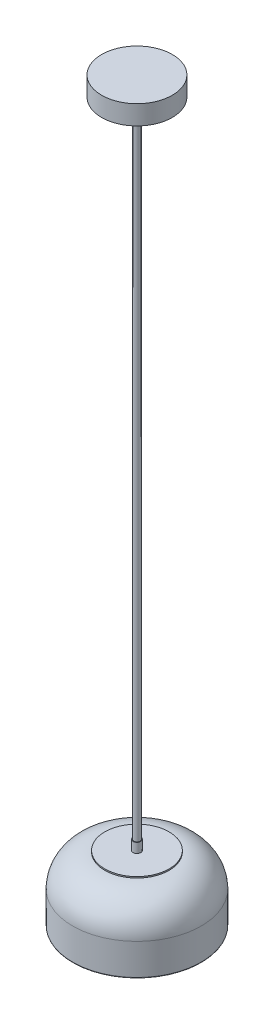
ISO-10303-21;
HEADER;
FILE_DESCRIPTION(('STEP AP214'),'2;1');
FILE_NAME('part.step','',(''),(''),'','','');
FILE_SCHEMA(('AUTOMOTIVE_DESIGN { 1 0 10303 214 1 1 1 1 }'));
ENDSEC;
DATA;
#1=APPLICATION_CONTEXT('core data for automotive mechanical design processes');
#2=APPLICATION_PROTOCOL_DEFINITION('international standard','automotive_design',2000,#1);
#3=PRODUCT_CONTEXT('',#1,'mechanical');
#4=PRODUCT('Part','Part','',(#3));
#5=PRODUCT_RELATED_PRODUCT_CATEGORY('part','',(#4));
#6=PRODUCT_DEFINITION_FORMATION('','',#4);
#7=PRODUCT_DEFINITION_CONTEXT('part definition',#1,'design');
#8=PRODUCT_DEFINITION('design','',#6,#7);
#9=PRODUCT_DEFINITION_SHAPE('','',#8);
#10=(LENGTH_UNIT() NAMED_UNIT(*) SI_UNIT(.MILLI.,.METRE.));
#11=(NAMED_UNIT(*) PLANE_ANGLE_UNIT() SI_UNIT($,.RADIAN.));
#12=(NAMED_UNIT(*) SI_UNIT($,.STERADIAN.) SOLID_ANGLE_UNIT());
#13=UNCERTAINTY_MEASURE_WITH_UNIT(LENGTH_MEASURE(1.E-05),#10,'distance_accuracy_value','');
#14=(GEOMETRIC_REPRESENTATION_CONTEXT(3) GLOBAL_UNCERTAINTY_ASSIGNED_CONTEXT((#13)) GLOBAL_UNIT_ASSIGNED_CONTEXT((#10,
#11,#12)) REPRESENTATION_CONTEXT('',''));
#15=CARTESIAN_POINT('',(0.,0.,0.));
#16=DIRECTION('',(0.,0.,1.));
#17=DIRECTION('',(1.,0.,0.));
#18=AXIS2_PLACEMENT_3D('',#15,#16,#17);
#19=CARTESIAN_POINT('',(0.,32.,0.));
#20=DIRECTION('',(0.,-1.,0.));
#21=DIRECTION('',(0.,0.,-1.));
#22=AXIS2_PLACEMENT_3D('',#19,#20,#21);
#23=CYLINDRICAL_SURFACE('',#22,50.);
#24=CARTESIAN_POINT('',(0.,32.,0.));
#25=DIRECTION('',(0.,1.,0.));
#26=DIRECTION('',(0.,0.,1.));
#27=AXIS2_PLACEMENT_3D('',#24,#25,#26);
#28=CIRCLE('',#27,50.);
#29=CARTESIAN_POINT('',(0.,32.,50.));
#30=VERTEX_POINT('',#29);
#31=EDGE_CURVE('E57',#30,#30,#28,.T.);
#32=ORIENTED_EDGE('',*,*,#31,.F.);
#33=EDGE_LOOP('',(#32));
#34=FACE_BOUND('',#33,.T.);
#35=CARTESIAN_POINT('',(0.,30.,0.));
#36=DIRECTION('',(0.,1.,0.));
#37=DIRECTION('',(0.,0.,1.));
#38=AXIS2_PLACEMENT_3D('',#35,#36,#37);
#39=CIRCLE('',#38,50.);
#40=CARTESIAN_POINT('',(0.,30.,50.));
#41=VERTEX_POINT('',#40);
#42=EDGE_CURVE('E52',#41,#41,#39,.T.);
#43=ORIENTED_EDGE('',*,*,#42,.T.);
#44=EDGE_LOOP('',(#43));
#45=FACE_BOUND('',#44,.T.);
#46=ADVANCED_FACE('F49',(#34,#45),#23,.T.);
#47=CARTESIAN_POINT('',(0.,32.,0.));
#48=DIRECTION('',(0.,1.,0.));
#49=DIRECTION('',(0.,0.,1.));
#50=AXIS2_PLACEMENT_3D('',#47,#48,#49);
#51=PLANE('',#50);
#52=CARTESIAN_POINT('',(0.,32.,0.));
#53=DIRECTION('',(0.,1.,0.));
#54=DIRECTION('',(0.,0.,1.));
#55=AXIS2_PLACEMENT_3D('',#52,#53,#54);
#56=CIRCLE('',#55,6.);
#57=CARTESIAN_POINT('',(0.,32.,6.));
#58=VERTEX_POINT('',#57);
#59=EDGE_CURVE('E71',#58,#58,#56,.T.);
#60=ORIENTED_EDGE('',*,*,#59,.F.);
#61=EDGE_LOOP('',(#60));
#62=FACE_BOUND('',#61,.T.);
#63=ORIENTED_EDGE('',*,*,#31,.T.);
#64=EDGE_LOOP('',(#63));
#65=FACE_BOUND('',#64,.T.);
#66=ADVANCED_FACE('F103',(#62,#65),#51,.T.);
#67=CARTESIAN_POINT('',(0.,30.,0.));
#68=DIRECTION('',(0.,1.,0.));
#69=DIRECTION('',(0.,0.,1.));
#70=AXIS2_PLACEMENT_3D('',#67,#68,#69);
#71=PLANE('',#70);
#72=ORIENTED_EDGE('',*,*,#42,.F.);
#73=EDGE_LOOP('',(#72));
#74=FACE_BOUND('',#73,.T.);
#75=ADVANCED_FACE('F108',(#74),#71,.F.);
#76=CARTESIAN_POINT('',(0.,47.,0.));
#77=DIRECTION('',(0.,-1.,0.));
#78=DIRECTION('',(0.,0.,-1.));
#79=AXIS2_PLACEMENT_3D('',#76,#77,#78);
#80=CYLINDRICAL_SURFACE('',#79,6.);
#81=CARTESIAN_POINT('',(0.,47.,0.));
#82=DIRECTION('',(0.,1.,0.));
#83=DIRECTION('',(0.,0.,1.));
#84=AXIS2_PLACEMENT_3D('',#81,#82,#83);
#85=CIRCLE('',#84,6.);
#86=CARTESIAN_POINT('',(0.,47.,6.));
#87=VERTEX_POINT('',#86);
#88=EDGE_CURVE('E67',#87,#87,#85,.T.);
#89=ORIENTED_EDGE('',*,*,#88,.F.);
#90=EDGE_LOOP('',(#89));
#91=FACE_BOUND('',#90,.T.);
#92=ORIENTED_EDGE('',*,*,#59,.T.);
#93=EDGE_LOOP('',(#92));
#94=FACE_BOUND('',#93,.T.);
#95=ADVANCED_FACE('F118',(#91,#94),#80,.T.);
#96=CARTESIAN_POINT('',(0.,47.,0.));
#97=DIRECTION('',(0.,1.,0.));
#98=DIRECTION('',(0.,0.,1.));
#99=AXIS2_PLACEMENT_3D('',#96,#97,#98);
#100=PLANE('',#99);
#101=CARTESIAN_POINT('',(0.,47.,0.));
#102=DIRECTION('',(0.,1.,0.));
#103=DIRECTION('',(0.,0.,1.));
#104=AXIS2_PLACEMENT_3D('',#101,#102,#103);
#105=CIRCLE('',#104,5.);
#106=CARTESIAN_POINT('',(0.,47.,5.));
#107=VERTEX_POINT('',#106);
#108=EDGE_CURVE('E11',#107,#107,#105,.T.);
#109=ORIENTED_EDGE('',*,*,#108,.F.);
#110=EDGE_LOOP('',(#109));
#111=FACE_BOUND('',#110,.T.);
#112=ORIENTED_EDGE('',*,*,#88,.T.);
#113=EDGE_LOOP('',(#112));
#114=FACE_BOUND('',#113,.T.);
#115=ADVANCED_FACE('F122',(#111,#114),#100,.T.);
#116=CARTESIAN_POINT('',(0.,1047.,0.));
#117=DIRECTION('',(0.,-1.,0.));
#118=DIRECTION('',(0.,0.,-1.));
#119=AXIS2_PLACEMENT_3D('',#116,#117,#118);
#120=CYLINDRICAL_SURFACE('',#119,5.);
#121=CARTESIAN_POINT('',(0.,1047.,0.));
#122=DIRECTION('',(0.,1.,0.));
#123=DIRECTION('',(0.,0.,1.));
#124=AXIS2_PLACEMENT_3D('',#121,#122,#123);
#125=CIRCLE('',#124,5.);
#126=CARTESIAN_POINT('',(0.,1047.,5.));
#127=VERTEX_POINT('',#126);
#128=EDGE_CURVE('E65',#127,#127,#125,.T.);
#129=ORIENTED_EDGE('',*,*,#128,.F.);
#130=EDGE_LOOP('',(#129));
#131=FACE_BOUND('',#130,.T.);
#132=ORIENTED_EDGE('',*,*,#108,.T.);
#133=EDGE_LOOP('',(#132));
#134=FACE_BOUND('',#133,.T.);
#135=ADVANCED_FACE('F128',(#131,#134),#120,.T.);
#136=CARTESIAN_POINT('',(0.,1077.,0.));
#137=DIRECTION('',(0.,-1.,0.));
#138=DIRECTION('',(0.,0.,-1.));
#139=AXIS2_PLACEMENT_3D('',#136,#137,#138);
#140=CYLINDRICAL_SURFACE('',#139,54.991);
#141=CARTESIAN_POINT('',(0.,1077.,0.));
#142=DIRECTION('',(0.,1.,0.));
#143=DIRECTION('',(0.,0.,1.));
#144=AXIS2_PLACEMENT_3D('',#141,#142,#143);
#145=CIRCLE('',#144,54.991);
#146=CARTESIAN_POINT('',(0.,1077.,54.991));
#147=VERTEX_POINT('',#146);
#148=EDGE_CURVE('E78',#147,#147,#145,.T.);
#149=ORIENTED_EDGE('',*,*,#148,.F.);
#150=EDGE_LOOP('',(#149));
#151=FACE_BOUND('',#150,.T.);
#152=CARTESIAN_POINT('',(0.,1047.,0.));
#153=DIRECTION('',(0.,1.,0.));
#154=DIRECTION('',(0.,0.,1.));
#155=AXIS2_PLACEMENT_3D('',#152,#153,#154);
#156=CIRCLE('',#155,54.991);
#157=CARTESIAN_POINT('',(0.,1047.,54.991));
#158=VERTEX_POINT('',#157);
#159=EDGE_CURVE('E83',#158,#158,#156,.T.);
#160=ORIENTED_EDGE('',*,*,#159,.T.);
#161=EDGE_LOOP('',(#160));
#162=FACE_BOUND('',#161,.T.);
#163=ADVANCED_FACE('F91',(#151,#162),#140,.T.);
#164=CARTESIAN_POINT('',(0.,1077.,0.));
#165=DIRECTION('',(0.,1.,0.));
#166=DIRECTION('',(0.,0.,1.));
#167=AXIS2_PLACEMENT_3D('',#164,#165,#166);
#168=PLANE('',#167);
#169=ORIENTED_EDGE('',*,*,#148,.T.);
#170=EDGE_LOOP('',(#169));
#171=FACE_BOUND('',#170,.T.);
#172=ADVANCED_FACE('F95',(#171),#168,.T.);
#173=CARTESIAN_POINT('',(0.,1047.,0.));
#174=DIRECTION('',(0.,1.,0.));
#175=DIRECTION('',(0.,0.,1.));
#176=AXIS2_PLACEMENT_3D('',#173,#174,#175);
#177=PLANE('',#176);
#178=ORIENTED_EDGE('',*,*,#128,.T.);
#179=EDGE_LOOP('',(#178));
#180=FACE_BOUND('',#179,.T.);
#181=ORIENTED_EDGE('',*,*,#159,.F.);
#182=EDGE_LOOP('',(#181));
#183=FACE_BOUND('',#182,.T.);
#184=ADVANCED_FACE('F93',(#180,#183),#177,.F.);
#185=CLOSED_SHELL('',(#46,#66,#75,#95,#115,#135,#163,#172,#184));
#186=MANIFOLD_SOLID_BREP('B2',#185);
#187=CARTESIAN_POINT('',(0.,-10.,0.));
#188=DIRECTION('',(0.,1.,0.));
#189=DIRECTION('',(0.,0.,1.));
#190=AXIS2_PLACEMENT_3D('',#187,#188,#189);
#191=CYLINDRICAL_SURFACE('',#190,50.);
#192=CARTESIAN_POINT('',(0.,0.,0.));
#193=DIRECTION('',(0.,-1.,0.));
#194=DIRECTION('',(0.,0.,-1.));
#195=AXIS2_PLACEMENT_3D('',#192,#193,#194);
#196=CIRCLE('',#195,50.);
#197=CARTESIAN_POINT('',(0.,0.,-50.));
#198=VERTEX_POINT('',#197);
#199=EDGE_CURVE('E48',#198,#198,#196,.F.);
#200=ORIENTED_EDGE('',*,*,#199,.T.);
#201=EDGE_LOOP('',(#200));
#202=FACE_BOUND('',#201,.T.);
#203=CARTESIAN_POINT('',(0.,5.,0.));
#204=DIRECTION('',(0.,-1.,0.));
#205=DIRECTION('',(0.,0.,-1.));
#206=AXIS2_PLACEMENT_3D('',#203,#204,#205);
#207=CIRCLE('',#206,50.);
#208=CARTESIAN_POINT('',(0.,5.,-50.));
#209=VERTEX_POINT('',#208);
#210=EDGE_CURVE('E212',#209,#209,#207,.T.);
#211=ORIENTED_EDGE('',*,*,#210,.T.);
#212=EDGE_LOOP('',(#211));
#213=FACE_BOUND('',#212,.T.);
#214=ADVANCED_FACE('F201',(#202,#213),#191,.T.);
#215=CARTESIAN_POINT('',(0.,-10.,0.));
#216=DIRECTION('',(0.,-1.,0.));
#217=DIRECTION('',(0.,0.,-1.));
#218=AXIS2_PLACEMENT_3D('',#215,#216,#217);
#219=PLANE('',#218);
#220=CARTESIAN_POINT('',(0.,-10.,0.));
#221=DIRECTION('',(0.,-1.,0.));
#222=DIRECTION('',(0.,0.,-1.));
#223=AXIS2_PLACEMENT_3D('',#220,#221,#222);
#224=CIRCLE('',#223,40.);
#225=CARTESIAN_POINT('',(0.,-10.,-40.));
#226=VERTEX_POINT('',#225);
#227=EDGE_CURVE('E208',#226,#226,#224,.T.);
#228=ORIENTED_EDGE('',*,*,#227,.T.);
#229=EDGE_LOOP('',(#228));
#230=FACE_BOUND('',#229,.T.);
#231=ADVANCED_FACE('F222',(#230),#219,.T.);
#232=CARTESIAN_POINT('',(0.,5.,0.));
#233=DIRECTION('',(0.,-1.,0.));
#234=DIRECTION('',(0.,0.,-1.));
#235=AXIS2_PLACEMENT_3D('',#232,#233,#234);
#236=PLANE('',#235);
#237=ORIENTED_EDGE('',*,*,#210,.F.);
#238=EDGE_LOOP('',(#237));
#239=FACE_BOUND('',#238,.T.);
#240=ADVANCED_FACE('F220',(#239),#236,.F.);
#241=CARTESIAN_POINT('',(0.,0.,0.));
#242=DIRECTION('',(0.,-1.,0.));
#243=DIRECTION('',(0.,0.,-1.));
#244=AXIS2_PLACEMENT_3D('',#241,#242,#243);
#245=TOROIDAL_SURFACE('',#244,40.,10.);
#246=ORIENTED_EDGE('',*,*,#199,.F.);
#247=EDGE_LOOP('',(#246));
#248=FACE_BOUND('',#247,.T.);
#249=ORIENTED_EDGE('',*,*,#227,.F.);
#250=EDGE_LOOP('',(#249));
#251=FACE_BOUND('',#250,.T.);
#252=ADVANCED_FACE('F203',(#248,#251),#245,.T.);
#253=CLOSED_SHELL('',(#214,#231,#240,#252));
#254=MANIFOLD_SOLID_BREP('B6',#253);
#255=CARTESIAN_POINT('',(0.,5.,0.));
#256=DIRECTION('',(0.,1.,0.));
#257=DIRECTION('',(0.,0.,1.));
#258=AXIS2_PLACEMENT_3D('',#255,#256,#257);
#259=CYLINDRICAL_SURFACE('',#258,50.);
#260=CARTESIAN_POINT('',(0.,5.,0.));
#261=DIRECTION('',(0.,-1.,0.));
#262=DIRECTION('',(0.,0.,-1.));
#263=AXIS2_PLACEMENT_3D('',#260,#261,#262);
#264=CIRCLE('',#263,50.);
#265=CARTESIAN_POINT('',(0.,5.,-50.));
#266=VERTEX_POINT('',#265);
#267=EDGE_CURVE('E200',#266,#266,#264,.T.);
#268=ORIENTED_EDGE('',*,*,#267,.F.);
#269=EDGE_LOOP('',(#268));
#270=FACE_BOUND('',#269,.T.);
#271=CARTESIAN_POINT('',(0.,25.,0.));
#272=DIRECTION('',(0.,-1.,0.));
#273=DIRECTION('',(0.,0.,-1.));
#274=AXIS2_PLACEMENT_3D('',#271,#272,#273);
#275=CIRCLE('',#274,50.);
#276=CARTESIAN_POINT('',(0.,25.,-50.));
#277=VERTEX_POINT('',#276);
#278=EDGE_CURVE('E267',#277,#277,#275,.T.);
#279=ORIENTED_EDGE('',*,*,#278,.T.);
#280=EDGE_LOOP('',(#279));
#281=FACE_BOUND('',#280,.T.);
#282=ADVANCED_FACE('F264',(#270,#281),#259,.T.);
#283=CARTESIAN_POINT('',(0.,5.,0.));
#284=DIRECTION('',(0.,-1.,0.));
#285=DIRECTION('',(0.,0.,-1.));
#286=AXIS2_PLACEMENT_3D('',#283,#284,#285);
#287=PLANE('',#286);
#288=ORIENTED_EDGE('',*,*,#267,.T.);
#289=EDGE_LOOP('',(#288));
#290=FACE_BOUND('',#289,.T.);
#291=ADVANCED_FACE('F279',(#290),#287,.T.);
#292=CARTESIAN_POINT('',(0.,25.,0.));
#293=DIRECTION('',(0.,-1.,0.));
#294=DIRECTION('',(0.,0.,-1.));
#295=AXIS2_PLACEMENT_3D('',#292,#293,#294);
#296=PLANE('',#295);
#297=ORIENTED_EDGE('',*,*,#278,.F.);
#298=EDGE_LOOP('',(#297));
#299=FACE_BOUND('',#298,.T.);
#300=ADVANCED_FACE('F277',(#299),#296,.F.);
#301=CLOSED_SHELL('',(#282,#291,#300));
#302=MANIFOLD_SOLID_BREP('B43',#301);
#303=CARTESIAN_POINT('',(0.,25.,0.));
#304=DIRECTION('',(0.,1.,0.));
#305=DIRECTION('',(0.,0.,1.));
#306=AXIS2_PLACEMENT_3D('',#303,#304,#305);
#307=CYLINDRICAL_SURFACE('',#306,50.);
#308=CARTESIAN_POINT('',(0.,25.,0.));
#309=DIRECTION('',(0.,-1.,0.));
#310=DIRECTION('',(0.,0.,-1.));
#311=AXIS2_PLACEMENT_3D('',#308,#309,#310);
#312=CIRCLE('',#311,50.);
#313=CARTESIAN_POINT('',(0.,25.,-50.));
#314=VERTEX_POINT('',#313);
#315=EDGE_CURVE('E263',#314,#314,#312,.T.);
#316=ORIENTED_EDGE('',*,*,#315,.F.);
#317=EDGE_LOOP('',(#316));
#318=FACE_BOUND('',#317,.T.);
#319=CARTESIAN_POINT('',(0.,27.,0.));
#320=DIRECTION('',(0.,-1.,0.));
#321=DIRECTION('',(0.,0.,-1.));
#322=AXIS2_PLACEMENT_3D('',#319,#320,#321);
#323=CIRCLE('',#322,50.);
#324=CARTESIAN_POINT('',(0.,27.,-50.));
#325=VERTEX_POINT('',#324);
#326=EDGE_CURVE('E314',#325,#325,#323,.T.);
#327=ORIENTED_EDGE('',*,*,#326,.T.);
#328=EDGE_LOOP('',(#327));
#329=FACE_BOUND('',#328,.T.);
#330=ADVANCED_FACE('F311',(#318,#329),#307,.T.);
#331=CARTESIAN_POINT('',(0.,25.,0.));
#332=DIRECTION('',(0.,-1.,0.));
#333=DIRECTION('',(0.,0.,-1.));
#334=AXIS2_PLACEMENT_3D('',#331,#332,#333);
#335=PLANE('',#334);
#336=ORIENTED_EDGE('',*,*,#315,.T.);
#337=EDGE_LOOP('',(#336));
#338=FACE_BOUND('',#337,.T.);
#339=ADVANCED_FACE('F326',(#338),#335,.T.);
#340=CARTESIAN_POINT('',(0.,27.,0.));
#341=DIRECTION('',(0.,-1.,0.));
#342=DIRECTION('',(0.,0.,-1.));
#343=AXIS2_PLACEMENT_3D('',#340,#341,#342);
#344=PLANE('',#343);
#345=ORIENTED_EDGE('',*,*,#326,.F.);
#346=EDGE_LOOP('',(#345));
#347=FACE_BOUND('',#346,.T.);
#348=ADVANCED_FACE('F324',(#347),#344,.F.);
#349=CLOSED_SHELL('',(#330,#339,#348));
#350=MANIFOLD_SOLID_BREP('B195',#349);
#351=CARTESIAN_POINT('',(50.,30.,0.));
#352=DIRECTION('',(0.,-1.,0.));
#353=DIRECTION('',(1.,0.,0.));
#354=AXIS2_PLACEMENT_3D('',#351,#352,#353);
#355=PLANE('',#354);
#356=CARTESIAN_POINT('',(0.,30.,0.));
#357=DIRECTION('',(0.,1.,0.));
#358=DIRECTION('',(-1.,0.,0.));
#359=AXIS2_PLACEMENT_3D('',#356,#357,#358);
#360=CIRCLE('',#359,50.);
#361=CARTESIAN_POINT('',(-50.,30.,0.));
#362=VERTEX_POINT('',#361);
#363=EDGE_CURVE('E363',#362,#362,#360,.T.);
#364=ORIENTED_EDGE('',*,*,#363,.T.);
#365=EDGE_LOOP('',(#364));
#366=FACE_BOUND('',#365,.T.);
#367=ADVANCED_FACE('F351',(#366),#355,.F.);
#368=CARTESIAN_POINT('',(0.,-20.,0.));
#369=DIRECTION('',(0.,1.,0.));
#370=DIRECTION('',(-1.,0.,0.));
#371=AXIS2_PLACEMENT_3D('',#368,#369,#370);
#372=DEGENERATE_TOROIDAL_SURFACE('',#371,50.,50.,.T.);
#373=ORIENTED_EDGE('',*,*,#363,.F.);
#374=EDGE_LOOP('',(#373));
#375=FACE_BOUND('',#374,.T.);
#376=CARTESIAN_POINT('',(0.,-20.,0.));
#377=DIRECTION('',(0.,1.,0.));
#378=DIRECTION('',(-1.,0.,0.));
#379=AXIS2_PLACEMENT_3D('',#376,#377,#378);
#380=CIRCLE('',#379,100.);
#381=CARTESIAN_POINT('',(-100.,-20.,0.));
#382=VERTEX_POINT('',#381);
#383=EDGE_CURVE('E368',#382,#382,#380,.T.);
#384=ORIENTED_EDGE('',*,*,#383,.T.);
#385=EDGE_LOOP('',(#384));
#386=FACE_BOUND('',#385,.T.);
#387=ADVANCED_FACE('F391',(#375,#386),#372,.T.);
#388=CARTESIAN_POINT('',(0.,30.,0.));
#389=DIRECTION('',(0.,1.,0.));
#390=DIRECTION('',(-1.,0.,0.));
#391=AXIS2_PLACEMENT_3D('',#388,#389,#390);
#392=CYLINDRICAL_SURFACE('',#391,100.);
#393=CARTESIAN_POINT('',(0.,-68.5,0.));
#394=DIRECTION('',(0.,1.,0.));
#395=DIRECTION('',(-1.,0.,0.));
#396=AXIS2_PLACEMENT_3D('',#393,#394,#395);
#397=CIRCLE('',#396,100.);
#398=CARTESIAN_POINT('',(-100.,-68.5,0.));
#399=VERTEX_POINT('',#398);
#400=EDGE_CURVE('E359',#399,#399,#397,.T.);
#401=ORIENTED_EDGE('',*,*,#400,.T.);
#402=EDGE_LOOP('',(#401));
#403=FACE_BOUND('',#402,.T.);
#404=ORIENTED_EDGE('',*,*,#383,.F.);
#405=EDGE_LOOP('',(#404));
#406=FACE_BOUND('',#405,.T.);
#407=ADVANCED_FACE('F383',(#403,#406),#392,.T.);
#408=CARTESIAN_POINT('',(50.,27.,0.));
#409=DIRECTION('',(0.,-1.,0.));
#410=DIRECTION('',(1.,0.,0.));
#411=AXIS2_PLACEMENT_3D('',#408,#409,#410);
#412=PLANE('',#411);
#413=CARTESIAN_POINT('',(0.,27.,0.));
#414=DIRECTION('',(0.,1.,0.));
#415=DIRECTION('',(-1.,0.,0.));
#416=AXIS2_PLACEMENT_3D('',#413,#414,#415);
#417=CIRCLE('',#416,50.);
#418=CARTESIAN_POINT('',(-50.,27.,0.));
#419=VERTEX_POINT('',#418);
#420=EDGE_CURVE('E371',#419,#419,#417,.T.);
#421=ORIENTED_EDGE('',*,*,#420,.F.);
#422=EDGE_LOOP('',(#421));
#423=FACE_BOUND('',#422,.T.);
#424=ADVANCED_FACE('F381',(#423),#412,.T.);
#425=CARTESIAN_POINT('',(0.,-20.,0.));
#426=DIRECTION('',(0.,1.,0.));
#427=DIRECTION('',(-1.,0.,0.));
#428=AXIS2_PLACEMENT_3D('',#425,#426,#427);
#429=TOROIDAL_SURFACE('',#428,50.,47.);
#430=ORIENTED_EDGE('',*,*,#420,.T.);
#431=EDGE_LOOP('',(#430));
#432=FACE_BOUND('',#431,.T.);
#433=CARTESIAN_POINT('',(0.,-20.,0.));
#434=DIRECTION('',(0.,1.,0.));
#435=DIRECTION('',(-1.,0.,0.));
#436=AXIS2_PLACEMENT_3D('',#433,#434,#435);
#437=CIRCLE('',#436,97.);
#438=CARTESIAN_POINT('',(-97.,-20.,0.));
#439=VERTEX_POINT('',#438);
#440=EDGE_CURVE('E372',#439,#439,#437,.T.);
#441=ORIENTED_EDGE('',*,*,#440,.F.);
#442=EDGE_LOOP('',(#441));
#443=FACE_BOUND('',#442,.T.);
#444=ADVANCED_FACE('F378',(#432,#443),#429,.F.);
#445=CARTESIAN_POINT('',(0.,30.,0.));
#446=DIRECTION('',(0.,1.,0.));
#447=DIRECTION('',(-1.,0.,0.));
#448=AXIS2_PLACEMENT_3D('',#445,#446,#447);
#449=CYLINDRICAL_SURFACE('',#448,97.);
#450=CARTESIAN_POINT('',(0.,-68.5,0.));
#451=DIRECTION('',(0.,1.,0.));
#452=DIRECTION('',(-1.,0.,0.));
#453=AXIS2_PLACEMENT_3D('',#450,#451,#452);
#454=CIRCLE('',#453,97.);
#455=CARTESIAN_POINT('',(-97.,-68.5,0.));
#456=VERTEX_POINT('',#455);
#457=EDGE_CURVE('E310',#456,#456,#454,.F.);
#458=ORIENTED_EDGE('',*,*,#457,.T.);
#459=EDGE_LOOP('',(#458));
#460=FACE_BOUND('',#459,.T.);
#461=ORIENTED_EDGE('',*,*,#440,.T.);
#462=EDGE_LOOP('',(#461));
#463=FACE_BOUND('',#462,.T.);
#464=ADVANCED_FACE('F389',(#460,#463),#449,.F.);
#465=CARTESIAN_POINT('',(0.,-68.5,0.));
#466=DIRECTION('',(0.,1.,0.));
#467=DIRECTION('',(-1.,0.,0.));
#468=AXIS2_PLACEMENT_3D('',#465,#466,#467);
#469=TOROIDAL_SURFACE('',#468,98.5,1.5);
#470=ORIENTED_EDGE('',*,*,#457,.F.);
#471=EDGE_LOOP('',(#470));
#472=FACE_BOUND('',#471,.T.);
#473=CARTESIAN_POINT('',(0.,-70.,0.));
#474=DIRECTION('',(0.,1.,0.));
#475=DIRECTION('',(-1.,0.,0.));
#476=AXIS2_PLACEMENT_3D('',#473,#474,#475);
#477=CIRCLE('',#476,98.5);
#478=CARTESIAN_POINT('',(-98.5,-70.,0.));
#479=VERTEX_POINT('',#478);
#480=EDGE_CURVE('E355',#479,#479,#477,.T.);
#481=ORIENTED_EDGE('',*,*,#480,.F.);
#482=EDGE_LOOP('',(#481));
#483=FACE_BOUND('',#482,.T.);
#484=ADVANCED_FACE('F353',(#472,#483),#469,.T.);
#485=CARTESIAN_POINT('',(0.,-68.5,0.));
#486=DIRECTION('',(0.,1.,0.));
#487=DIRECTION('',(-1.,0.,0.));
#488=AXIS2_PLACEMENT_3D('',#485,#486,#487);
#489=TOROIDAL_SURFACE('',#488,98.5,1.5);
#490=ORIENTED_EDGE('',*,*,#480,.T.);
#491=EDGE_LOOP('',(#490));
#492=FACE_BOUND('',#491,.T.);
#493=ORIENTED_EDGE('',*,*,#400,.F.);
#494=EDGE_LOOP('',(#493));
#495=FACE_BOUND('',#494,.T.);
#496=ADVANCED_FACE('F402',(#492,#495),#489,.T.);
#497=CLOSED_SHELL('',(#367,#387,#407,#424,#444,#464,#484,#496));
#498=MANIFOLD_SOLID_BREP('B258',#497);
#499=ADVANCED_BREP_SHAPE_REPRESENTATION('',(#18,#186,#254,#302,#350,#498),#14);
#500=SHAPE_DEFINITION_REPRESENTATION(#9,#499);
ENDSEC;
END-ISO-10303-21;
